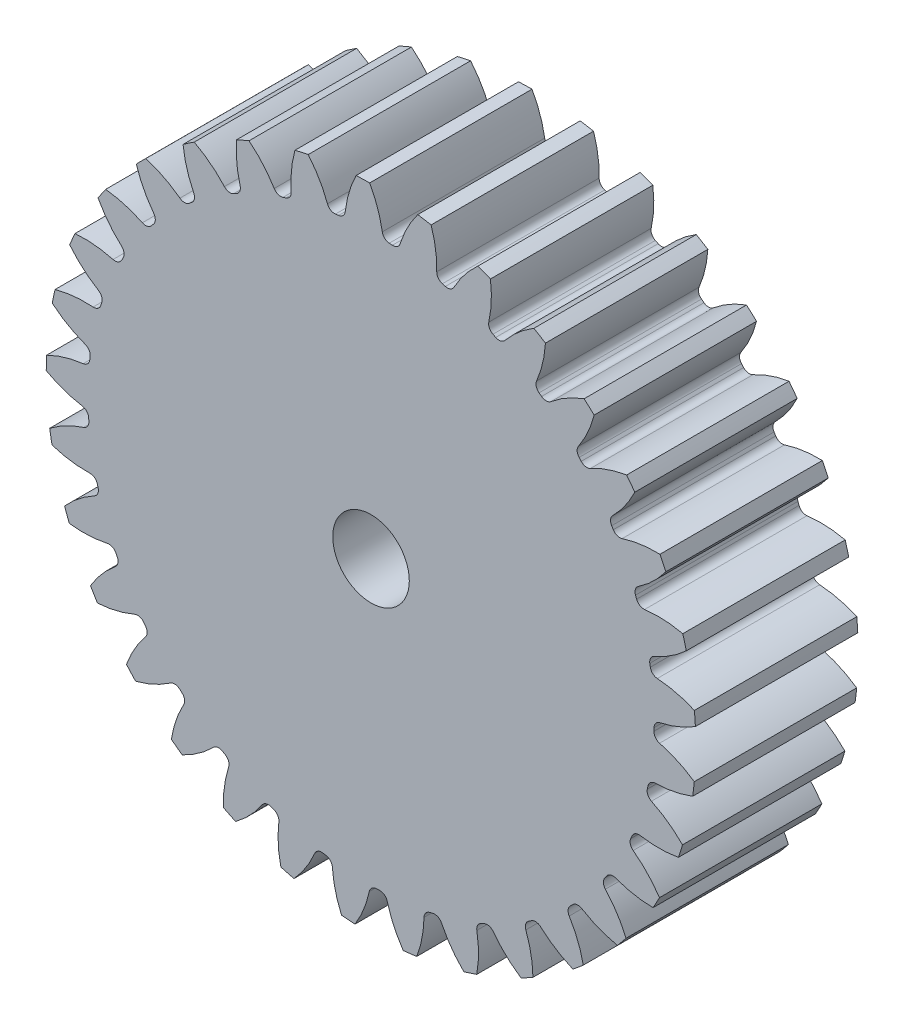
from build123d import *

# Parameters (mm, degrees)
SKETCH3_R         = 177.8
GEARBODY_DEPTH    = 88.9
TOOTHCUT_DEPTH    = 267.7
CIRPATTERN1_COUNT = 33
BOREDIA_R         = 20.955
BORE_DEPTH        = 12700


with BuildPart() as part:
    # Sketch3 → gearBody (new body)
    with BuildSketch(Plane.XY):
        Circle(SKETCH3_R)
    extrude(amount=GEARBODY_DEPTH)

    # Sketch2 → toothCut (cut, through all)
    with BuildSketch(Plane.XY):
        with BuildLine():
            ThreePointArc((154.879302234, -4.33651237), (154.900917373, -3.479855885), (154.917794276, -2.623092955))
            ThreePointArc((154.917794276, -2.623092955), (155.858334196, -0.066759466), (158.184765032, 1.349988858))
            ThreePointArc((158.184765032, 1.349988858), (168.34754346, 4.490627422), (177.8, 9.368817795))
            ThreePointArc((177.8, 9.368817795), (178.001753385, -3.998817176), (177.199897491, -17.343906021))
            ThreePointArc((177.199897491, -17.343906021), (167.976043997, -12.046151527), (157.964556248, -8.45229719))
            ThreePointArc((157.964556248, -8.45229719), (155.704094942, -6.932504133), (154.879302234, -4.33651237))
        make_face()
    toothcut = extrude(amount=TOOTHCUT_DEPTH, mode=Mode.SUBTRACT)

    # CirPattern1: toothCut ×33 about axis
    cirpattern1_axis = Axis((0, 0, 0), (0, 0, 1))
    for i in range(1, CIRPATTERN1_COUNT):
        add(toothcut.rotate(cirpattern1_axis, i * 360 / CIRPATTERN1_COUNT), mode=Mode.SUBTRACT)

    # boreDia → bore (cut, symmetric)
    with BuildSketch(Plane.XY):
        Circle(BOREDIA_R)
    extrude(amount=BORE_DEPTH, both=True, mode=Mode.SUBTRACT)


solid = part.part
